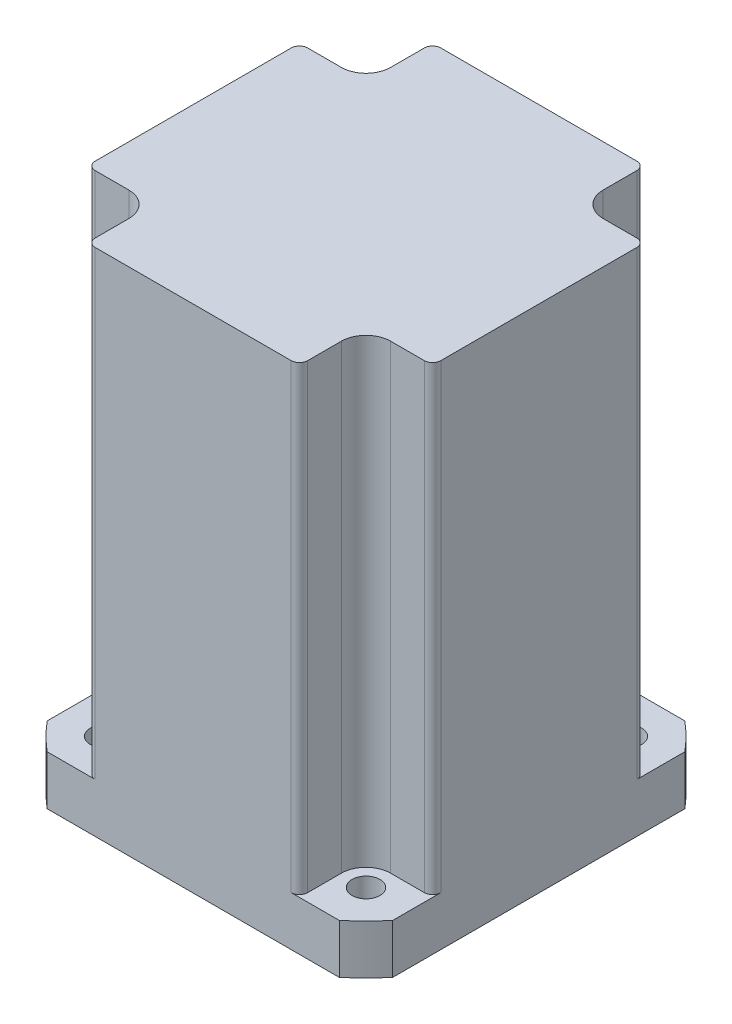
from build123d import *

# Parameters (mm, degrees)
SKETCH1_W                      = 56
SKETCH1_H                      = 33.909902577
BOSS_EXTRUDE1_DEPTH            = 25.819805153
SKETCH2_W                      = 25.819805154
SKETCH2_H                      = 56
BOSS_EXTRUDE2_DEPTH            = 8.090097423
SKETCH3_W                      = 25.819805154
SKETCH3_H                      = 56
BOSS_EXTRUDE3_DEPTH            = 8.090097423
SKETCH4_W                      = 25.819805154
SKETCH4_H                      = 56
BOSS_EXTRUDE4_DEPTH            = 8.090097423
BOSS_EXTRUDE5_DEPTH            = 6
F_3_4_3_4_DIAMETER_HOLE1_D     = 3.4
F_3_4_3_4_DIAMETER_HOLE1_DEPTH = 62.00005
F_2_0_2_DIAMETER_HOLE1_D       = 2
F_2_0_2_DIAMETER_HOLE1_DEPTH   = 6
CHAMFER1_SIZE                  = 0.200116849
CHAMFER1_SIZE2                 = 0.200097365
FILLET1_R                      = 1
FILLET2_R                      = 3


with BuildPart() as part:
    # Sketch1 → Boss-Extrude1 (new body)
    with BuildSketch(Plane(origin=(-12.909902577, 0, 0), x_dir=(0, -1, 0), z_dir=(-1, 0, 0))):
        with Locations((-34, 4.045048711)):
            Rectangle(SKETCH1_W, SKETCH1_H)
    extrude(amount=-BOSS_EXTRUDE1_DEPTH)

    # Sketch2 → Boss-Extrude2 (add)
    with BuildSketch(Plane(origin=(12.909902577, 0, 0), x_dir=(0, 0, -1), z_dir=(1, 0, 0))):
        with Locations((0, 34)):
            Rectangle(SKETCH2_W, SKETCH2_H)
    extrude(amount=BOSS_EXTRUDE2_DEPTH)

    # Sketch3 → Boss-Extrude3 (add)
    with BuildSketch(Plane(origin=(0, 0, -12.909902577), x_dir=(-1, 0, 0), z_dir=(0, 0, -1))):
        with Locations((0, 34)):
            Rectangle(SKETCH3_W, SKETCH3_H)
    extrude(amount=BOSS_EXTRUDE3_DEPTH)

    # Sketch4 → Boss-Extrude4 (add)
    with BuildSketch(Plane.ZY.offset(12.909902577)):
        with Locations((0, 34)):
            Rectangle(SKETCH4_W, SKETCH4_H)
    extrude(amount=BOSS_EXTRUDE4_DEPTH)

    # Sketch5 → Boss-Extrude5 (add)
    with BuildSketch(Plane.XZ.offset(-6)):
        with BuildLine():
            Line((-21, -17.755280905), (-21, 17.755280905))
            ThreePointArc((-21, 17.755280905), (-19.445436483, 19.445436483), (-17.755280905, 21))
            Line((-17.755280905, 21), (17.755280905, 21))
            ThreePointArc((17.755280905, 21), (19.445436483, 19.445436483), (21, 17.755280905))
            Line((21, 17.755280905), (21, -17.755280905))
            ThreePointArc((21, -17.755280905), (19.445436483, -19.445436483), (17.755280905, -21))
            Line((17.755280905, -21), (-17.755280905, -21))
            ThreePointArc((-17.755280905, -21), (-19.445436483, -19.445436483), (-21, -17.755280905))
        make_face()
    extrude(amount=BOSS_EXTRUDE5_DEPTH)

    # 3.4 _3.4_ Diameter Hole1
    with Locations(Plane.XZ):
        with Locations((15.909902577, -15.909902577), (-15.909902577, -15.909902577), (-15.909902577, 15.909902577), (15.909902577, 15.909902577)):
            Hole(F_3_4_3_4_DIAMETER_HOLE1_D / 2, depth=F_3_4_3_4_DIAMETER_HOLE1_DEPTH)

    # 2.0 _2_ Diameter Hole1
    with Locations(Plane.ZY.offset(21)):
        with Locations((-9.7, 50.8), (0, 50.8)):
            Hole(F_2_0_2_DIAMETER_HOLE1_D / 2, depth=F_2_0_2_DIAMETER_HOLE1_DEPTH)

    # Chamfer1
    chamfer1_edges = [part.edges().sort_by_distance(p)[0] for p in [
        (-21, 50.8, 1),
        (-21, 50.8, -8.7),
    ]]
    chamfer1_side = [part.faces().sort_by_distance(p)[0] for p in [
        (-21, 29.939634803, 0.018438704),
    ]]
    chamfer(chamfer1_edges, length=CHAMFER1_SIZE, length2=CHAMFER1_SIZE2, reference=chamfer1_side[0])

    # Fillet1
    fillet1_edges = [part.edges().sort_by_distance(p)[0] for p in [
        (21, 34, -12.909902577),
        (-12.909902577, 34, -21),
        (12.909902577, 34, -21),
        (-21, 34, -12.909902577),
        (-21, 34, 12.909902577),
        (21, 34, 12.909902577),
        (12.909902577, 34, 21),
        (-12.909902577, 34, 21),
    ]]
    fillet(fillet1_edges, radius=FILLET1_R)

    # Fillet2
    fillet2_edges = [part.edges().sort_by_distance(p)[0] for p in [
        (-12.909902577, 34, 12.909902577),
        (-12.909902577, 34, -12.909902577),
        (12.909902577, 34, -12.909902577),
        (12.909902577, 34, 12.909902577),
    ]]
    fillet(fillet2_edges, radius=FILLET2_R)


solid = part.part
